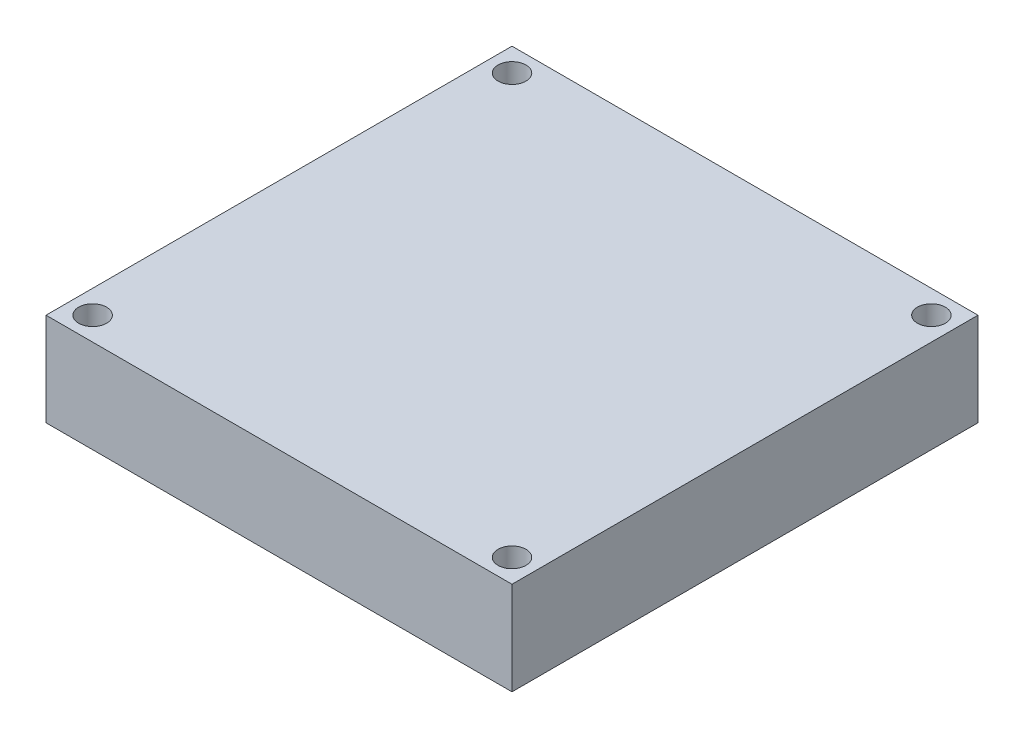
ISO-10303-21;
HEADER;
FILE_DESCRIPTION(('STEP AP214'),'2;1');
FILE_NAME('part.step','',(''),(''),'','','');
FILE_SCHEMA(('AUTOMOTIVE_DESIGN { 1 0 10303 214 1 1 1 1 }'));
ENDSEC;
DATA;
#1=APPLICATION_CONTEXT('core data for automotive mechanical design processes');
#2=APPLICATION_PROTOCOL_DEFINITION('international standard','automotive_design',2000,#1);
#3=PRODUCT_CONTEXT('',#1,'mechanical');
#4=PRODUCT('Part','Part','',(#3));
#5=PRODUCT_RELATED_PRODUCT_CATEGORY('part','',(#4));
#6=PRODUCT_DEFINITION_FORMATION('','',#4);
#7=PRODUCT_DEFINITION_CONTEXT('part definition',#1,'design');
#8=PRODUCT_DEFINITION('design','',#6,#7);
#9=PRODUCT_DEFINITION_SHAPE('','',#8);
#10=(LENGTH_UNIT() NAMED_UNIT(*) SI_UNIT(.MILLI.,.METRE.));
#11=(NAMED_UNIT(*) PLANE_ANGLE_UNIT() SI_UNIT($,.RADIAN.));
#12=(NAMED_UNIT(*) SI_UNIT($,.STERADIAN.) SOLID_ANGLE_UNIT());
#13=UNCERTAINTY_MEASURE_WITH_UNIT(LENGTH_MEASURE(1.E-05),#10,'distance_accuracy_value','');
#14=(GEOMETRIC_REPRESENTATION_CONTEXT(3) GLOBAL_UNCERTAINTY_ASSIGNED_CONTEXT((#13)) GLOBAL_UNIT_ASSIGNED_CONTEXT((#10,
#11,#12)) REPRESENTATION_CONTEXT('',''));
#15=CARTESIAN_POINT('',(0.,0.,0.));
#16=DIRECTION('',(0.,0.,1.));
#17=DIRECTION('',(1.,0.,0.));
#18=AXIS2_PLACEMENT_3D('',#15,#16,#17);
#19=CARTESIAN_POINT('',(-25.,10.,-25.));
#20=DIRECTION('',(1.,0.,0.));
#21=DIRECTION('',(0.,0.,-1.));
#22=AXIS2_PLACEMENT_3D('',#19,#20,#21);
#23=PLANE('',#22);
#24=DIRECTION('',(0.,0.,1.));
#25=VECTOR('',#24,1.);
#26=CARTESIAN_POINT('',(-25.,0.,-25.));
#27=LINE('',#26,#25);
#28=CARTESIAN_POINT('',(-25.,0.,-25.));
#29=VERTEX_POINT('',#28);
#30=CARTESIAN_POINT('',(-25.,0.,25.));
#31=VERTEX_POINT('',#30);
#32=EDGE_CURVE('E98',#29,#31,#27,.T.);
#33=ORIENTED_EDGE('',*,*,#32,.T.);
#34=DIRECTION('',(0.,-1.,0.));
#35=VECTOR('',#34,1.);
#36=CARTESIAN_POINT('',(-25.,10.,25.));
#37=LINE('',#36,#35);
#38=CARTESIAN_POINT('',(-25.,10.,25.));
#39=VERTEX_POINT('',#38);
#40=EDGE_CURVE('E11',#39,#31,#37,.T.);
#41=ORIENTED_EDGE('',*,*,#40,.F.);
#42=DIRECTION('',(0.,0.,1.));
#43=VECTOR('',#42,1.);
#44=CARTESIAN_POINT('',(-25.,10.,-25.));
#45=LINE('',#44,#43);
#46=CARTESIAN_POINT('',(-25.,10.,-25.));
#47=VERTEX_POINT('',#46);
#48=EDGE_CURVE('E86',#47,#39,#45,.T.);
#49=ORIENTED_EDGE('',*,*,#48,.F.);
#50=DIRECTION('',(0.,-1.,0.));
#51=VECTOR('',#50,1.);
#52=CARTESIAN_POINT('',(-25.,10.,-25.));
#53=LINE('',#52,#51);
#54=EDGE_CURVE('E94',#47,#29,#53,.T.);
#55=ORIENTED_EDGE('',*,*,#54,.T.);
#56=EDGE_LOOP('',(#33,#41,#49,#55));
#57=FACE_BOUND('',#56,.T.);
#58=ADVANCED_FACE('F35',(#57),#23,.F.);
#59=CARTESIAN_POINT('',(25.,10.,25.));
#60=DIRECTION('',(0.,0.,-1.));
#61=DIRECTION('',(-1.,0.,0.));
#62=AXIS2_PLACEMENT_3D('',#59,#60,#61);
#63=PLANE('',#62);
#64=DIRECTION('',(1.,0.,0.));
#65=VECTOR('',#64,1.);
#66=CARTESIAN_POINT('',(25.,0.,25.));
#67=LINE('',#66,#65);
#68=CARTESIAN_POINT('',(25.,0.,25.));
#69=VERTEX_POINT('',#68);
#70=EDGE_CURVE('E90',#31,#69,#67,.T.);
#71=ORIENTED_EDGE('',*,*,#70,.T.);
#72=DIRECTION('',(0.,-1.,0.));
#73=VECTOR('',#72,1.);
#74=CARTESIAN_POINT('',(25.,10.,25.));
#75=LINE('',#74,#73);
#76=CARTESIAN_POINT('',(25.,10.,25.));
#77=VERTEX_POINT('',#76);
#78=EDGE_CURVE('E43',#77,#69,#75,.T.);
#79=ORIENTED_EDGE('',*,*,#78,.F.);
#80=DIRECTION('',(1.,0.,0.));
#81=VECTOR('',#80,1.);
#82=CARTESIAN_POINT('',(25.,10.,25.));
#83=LINE('',#82,#81);
#84=EDGE_CURVE('E81',#39,#77,#83,.T.);
#85=ORIENTED_EDGE('',*,*,#84,.F.);
#86=ORIENTED_EDGE('',*,*,#40,.T.);
#87=EDGE_LOOP('',(#71,#79,#85,#86));
#88=FACE_BOUND('',#87,.T.);
#89=ADVANCED_FACE('F89',(#88),#63,.F.);
#90=CARTESIAN_POINT('',(25.,10.,-25.));
#91=DIRECTION('',(-1.,0.,0.));
#92=DIRECTION('',(0.,0.,1.));
#93=AXIS2_PLACEMENT_3D('',#90,#91,#92);
#94=PLANE('',#93);
#95=DIRECTION('',(0.,0.,-1.));
#96=VECTOR('',#95,1.);
#97=CARTESIAN_POINT('',(25.,0.,-25.));
#98=LINE('',#97,#96);
#99=CARTESIAN_POINT('',(25.,0.,-25.));
#100=VERTEX_POINT('',#99);
#101=EDGE_CURVE('E68',#69,#100,#98,.T.);
#102=ORIENTED_EDGE('',*,*,#101,.T.);
#103=DIRECTION('',(0.,-1.,0.));
#104=VECTOR('',#103,1.);
#105=CARTESIAN_POINT('',(25.,10.,-25.));
#106=LINE('',#105,#104);
#107=CARTESIAN_POINT('',(25.,10.,-25.));
#108=VERTEX_POINT('',#107);
#109=EDGE_CURVE('E91',#108,#100,#106,.T.);
#110=ORIENTED_EDGE('',*,*,#109,.F.);
#111=DIRECTION('',(0.,0.,-1.));
#112=VECTOR('',#111,1.);
#113=CARTESIAN_POINT('',(25.,10.,-25.));
#114=LINE('',#113,#112);
#115=EDGE_CURVE('E84',#77,#108,#114,.T.);
#116=ORIENTED_EDGE('',*,*,#115,.F.);
#117=ORIENTED_EDGE('',*,*,#78,.T.);
#118=EDGE_LOOP('',(#102,#110,#116,#117));
#119=FACE_BOUND('',#118,.T.);
#120=ADVANCED_FACE('F92',(#119),#94,.F.);
#121=CARTESIAN_POINT('',(25.,10.,-25.));
#122=DIRECTION('',(0.,0.,1.));
#123=DIRECTION('',(1.,0.,0.));
#124=AXIS2_PLACEMENT_3D('',#121,#122,#123);
#125=PLANE('',#124);
#126=DIRECTION('',(-1.,0.,0.));
#127=VECTOR('',#126,1.);
#128=CARTESIAN_POINT('',(25.,0.,-25.));
#129=LINE('',#128,#127);
#130=EDGE_CURVE('E74',#100,#29,#129,.T.);
#131=ORIENTED_EDGE('',*,*,#130,.T.);
#132=ORIENTED_EDGE('',*,*,#54,.F.);
#133=DIRECTION('',(-1.,0.,0.));
#134=VECTOR('',#133,1.);
#135=CARTESIAN_POINT('',(25.,10.,-25.));
#136=LINE('',#135,#134);
#137=EDGE_CURVE('E51',#108,#47,#136,.T.);
#138=ORIENTED_EDGE('',*,*,#137,.F.);
#139=ORIENTED_EDGE('',*,*,#109,.T.);
#140=EDGE_LOOP('',(#131,#132,#138,#139));
#141=FACE_BOUND('',#140,.T.);
#142=ADVANCED_FACE('F106',(#141),#125,.F.);
#143=CARTESIAN_POINT('',(-25.,10.,25.));
#144=DIRECTION('',(0.,-1.,0.));
#145=DIRECTION('',(0.,0.,-1.));
#146=AXIS2_PLACEMENT_3D('',#143,#144,#145);
#147=PLANE('',#146);
#148=CARTESIAN_POINT('',(22.5,10.,22.5));
#149=DIRECTION('',(0.,1.,0.));
#150=DIRECTION('',(0.,0.,1.));
#151=AXIS2_PLACEMENT_3D('',#148,#149,#150);
#152=CIRCLE('',#151,1.5);
#153=CARTESIAN_POINT('',(22.5,10.,24.));
#154=VERTEX_POINT('',#153);
#155=EDGE_CURVE('E130',#154,#154,#152,.T.);
#156=ORIENTED_EDGE('',*,*,#155,.F.);
#157=EDGE_LOOP('',(#156));
#158=FACE_BOUND('',#157,.T.);
#159=CARTESIAN_POINT('',(-22.5,10.,22.5));
#160=DIRECTION('',(0.,1.,0.));
#161=DIRECTION('',(0.,0.,1.));
#162=AXIS2_PLACEMENT_3D('',#159,#160,#161);
#163=CIRCLE('',#162,1.5);
#164=CARTESIAN_POINT('',(-22.5,10.,24.));
#165=VERTEX_POINT('',#164);
#166=EDGE_CURVE('E124',#165,#165,#163,.T.);
#167=ORIENTED_EDGE('',*,*,#166,.F.);
#168=EDGE_LOOP('',(#167));
#169=FACE_BOUND('',#168,.T.);
#170=CARTESIAN_POINT('',(22.5,10.,-22.5));
#171=DIRECTION('',(0.,1.,0.));
#172=DIRECTION('',(0.,0.,1.));
#173=AXIS2_PLACEMENT_3D('',#170,#171,#172);
#174=CIRCLE('',#173,1.5);
#175=CARTESIAN_POINT('',(22.5,10.,-21.));
#176=VERTEX_POINT('',#175);
#177=EDGE_CURVE('E118',#176,#176,#174,.T.);
#178=ORIENTED_EDGE('',*,*,#177,.F.);
#179=EDGE_LOOP('',(#178));
#180=FACE_BOUND('',#179,.T.);
#181=CARTESIAN_POINT('',(-22.5,10.,-22.5));
#182=DIRECTION('',(0.,1.,0.));
#183=DIRECTION('',(0.,0.,1.));
#184=AXIS2_PLACEMENT_3D('',#181,#182,#183);
#185=CIRCLE('',#184,1.5);
#186=CARTESIAN_POINT('',(-22.5,10.,-21.));
#187=VERTEX_POINT('',#186);
#188=EDGE_CURVE('E112',#187,#187,#185,.T.);
#189=ORIENTED_EDGE('',*,*,#188,.F.);
#190=EDGE_LOOP('',(#189));
#191=FACE_BOUND('',#190,.T.);
#192=ORIENTED_EDGE('',*,*,#48,.T.);
#193=ORIENTED_EDGE('',*,*,#84,.T.);
#194=ORIENTED_EDGE('',*,*,#115,.T.);
#195=ORIENTED_EDGE('',*,*,#137,.T.);
#196=EDGE_LOOP('',(#192,#193,#194,#195));
#197=FACE_BOUND('',#196,.T.);
#198=ADVANCED_FACE('F82',(#158,#169,#180,#191,#197),#147,.F.);
#199=CARTESIAN_POINT('',(-25.,0.,25.));
#200=DIRECTION('',(0.,-1.,0.));
#201=DIRECTION('',(0.,0.,-1.));
#202=AXIS2_PLACEMENT_3D('',#199,#200,#201);
#203=PLANE('',#202);
#204=CARTESIAN_POINT('',(22.5,0.,22.5));
#205=DIRECTION('',(0.,1.,0.));
#206=DIRECTION('',(0.,0.,1.));
#207=AXIS2_PLACEMENT_3D('',#204,#205,#206);
#208=CIRCLE('',#207,1.5);
#209=CARTESIAN_POINT('',(22.5,0.,24.));
#210=VERTEX_POINT('',#209);
#211=EDGE_CURVE('E127',#210,#210,#208,.T.);
#212=ORIENTED_EDGE('',*,*,#211,.T.);
#213=EDGE_LOOP('',(#212));
#214=FACE_BOUND('',#213,.T.);
#215=CARTESIAN_POINT('',(-22.5,0.,22.5));
#216=DIRECTION('',(0.,1.,0.));
#217=DIRECTION('',(0.,0.,1.));
#218=AXIS2_PLACEMENT_3D('',#215,#216,#217);
#219=CIRCLE('',#218,1.5);
#220=CARTESIAN_POINT('',(-22.5,0.,24.));
#221=VERTEX_POINT('',#220);
#222=EDGE_CURVE('E121',#221,#221,#219,.T.);
#223=ORIENTED_EDGE('',*,*,#222,.T.);
#224=EDGE_LOOP('',(#223));
#225=FACE_BOUND('',#224,.T.);
#226=CARTESIAN_POINT('',(22.5,0.,-22.5));
#227=DIRECTION('',(0.,1.,0.));
#228=DIRECTION('',(0.,0.,1.));
#229=AXIS2_PLACEMENT_3D('',#226,#227,#228);
#230=CIRCLE('',#229,1.5);
#231=CARTESIAN_POINT('',(22.5,0.,-21.));
#232=VERTEX_POINT('',#231);
#233=EDGE_CURVE('E115',#232,#232,#230,.T.);
#234=ORIENTED_EDGE('',*,*,#233,.T.);
#235=EDGE_LOOP('',(#234));
#236=FACE_BOUND('',#235,.T.);
#237=CARTESIAN_POINT('',(-22.5,0.,-22.5));
#238=DIRECTION('',(0.,1.,0.));
#239=DIRECTION('',(0.,0.,1.));
#240=AXIS2_PLACEMENT_3D('',#237,#238,#239);
#241=CIRCLE('',#240,1.5);
#242=CARTESIAN_POINT('',(-22.5,0.,-21.));
#243=VERTEX_POINT('',#242);
#244=EDGE_CURVE('E101',#243,#243,#241,.T.);
#245=ORIENTED_EDGE('',*,*,#244,.T.);
#246=EDGE_LOOP('',(#245));
#247=FACE_BOUND('',#246,.T.);
#248=ORIENTED_EDGE('',*,*,#32,.F.);
#249=ORIENTED_EDGE('',*,*,#130,.F.);
#250=ORIENTED_EDGE('',*,*,#101,.F.);
#251=ORIENTED_EDGE('',*,*,#70,.F.);
#252=EDGE_LOOP('',(#248,#249,#250,#251));
#253=FACE_BOUND('',#252,.T.);
#254=ADVANCED_FACE('F109',(#214,#225,#236,#247,#253),#203,.T.);
#255=CARTESIAN_POINT('',(-22.5,0.,-22.5));
#256=DIRECTION('',(0.,1.,0.));
#257=DIRECTION('',(0.,0.,1.));
#258=AXIS2_PLACEMENT_3D('',#255,#256,#257);
#259=CYLINDRICAL_SURFACE('',#258,1.5);
#260=ORIENTED_EDGE('',*,*,#244,.F.);
#261=EDGE_LOOP('',(#260));
#262=FACE_BOUND('',#261,.T.);
#263=ORIENTED_EDGE('',*,*,#188,.T.);
#264=EDGE_LOOP('',(#263));
#265=FACE_BOUND('',#264,.T.);
#266=ADVANCED_FACE('F154',(#262,#265),#259,.F.);
#267=CARTESIAN_POINT('',(22.5,0.,-22.5));
#268=DIRECTION('',(0.,1.,0.));
#269=DIRECTION('',(0.,0.,1.));
#270=AXIS2_PLACEMENT_3D('',#267,#268,#269);
#271=CYLINDRICAL_SURFACE('',#270,1.5);
#272=ORIENTED_EDGE('',*,*,#233,.F.);
#273=EDGE_LOOP('',(#272));
#274=FACE_BOUND('',#273,.T.);
#275=ORIENTED_EDGE('',*,*,#177,.T.);
#276=EDGE_LOOP('',(#275));
#277=FACE_BOUND('',#276,.T.);
#278=ADVANCED_FACE('F156',(#274,#277),#271,.F.);
#279=CARTESIAN_POINT('',(-22.5,0.,22.5));
#280=DIRECTION('',(0.,1.,0.));
#281=DIRECTION('',(0.,0.,1.));
#282=AXIS2_PLACEMENT_3D('',#279,#280,#281);
#283=CYLINDRICAL_SURFACE('',#282,1.5);
#284=ORIENTED_EDGE('',*,*,#222,.F.);
#285=EDGE_LOOP('',(#284));
#286=FACE_BOUND('',#285,.T.);
#287=ORIENTED_EDGE('',*,*,#166,.T.);
#288=EDGE_LOOP('',(#287));
#289=FACE_BOUND('',#288,.T.);
#290=ADVANCED_FACE('F141',(#286,#289),#283,.F.);
#291=CARTESIAN_POINT('',(22.5,0.,22.5));
#292=DIRECTION('',(0.,1.,0.));
#293=DIRECTION('',(0.,0.,1.));
#294=AXIS2_PLACEMENT_3D('',#291,#292,#293);
#295=CYLINDRICAL_SURFACE('',#294,1.5);
#296=ORIENTED_EDGE('',*,*,#211,.F.);
#297=EDGE_LOOP('',(#296));
#298=FACE_BOUND('',#297,.T.);
#299=ORIENTED_EDGE('',*,*,#155,.T.);
#300=EDGE_LOOP('',(#299));
#301=FACE_BOUND('',#300,.T.);
#302=ADVANCED_FACE('F138',(#298,#301),#295,.F.);
#303=CLOSED_SHELL('',(#58,#89,#120,#142,#198,#254,#266,#278,#290,#302));
#304=MANIFOLD_SOLID_BREP('B2',#303);
#305=ADVANCED_BREP_SHAPE_REPRESENTATION('',(#18,#304),#14);
#306=SHAPE_DEFINITION_REPRESENTATION(#9,#305);
ENDSEC;
END-ISO-10303-21;
